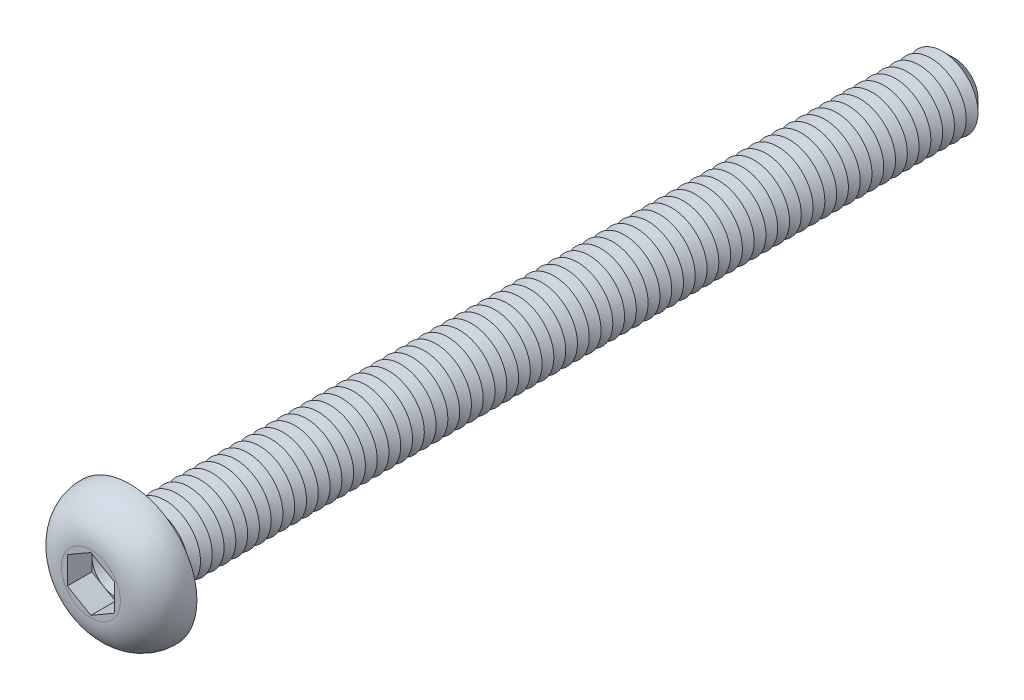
from build123d import *

# Parameters (mm, degrees)
CUT_EXTRUDE1_DEPTH  = 1.04
SKETCH4_R           = 1.5
BOSS_EXTRUDE1_DEPTH = 35
CHAMFER1_SIZE       = 0.5
LPATTERN1_COUNT     = 68
LPATTERN1_PITCH     = 0.5
FILLET2_R           = 0.2


with BuildPart() as part:
    # Sketch2 → Revolve1 (revolve)
    with BuildSketch(Plane(origin=(0, 0, 0), x_dir=(0, 0, -1), z_dir=(1, 0, 0)), mode=Mode.PRIVATE) as revolve1_sk:
        with BuildLine():
            Line((0, 0), (-1.65, 0))
            Line((-1.65, 0), (-1.65, 1.250781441))
            ThreePointArc((-1.65, 1.250781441), (-1.163552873, 2.39969397), (0, 2.85))
            Line((0, 2.85), (0, 0))
        make_face()
    revolve(revolve1_sk.sketch.rotate(Axis((0, 0, 47.934239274), (0, 0, -1)), 90), axis=Axis((0, 0, 47.934239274), (0, 0, -1)))

    # Sketch3 → Cut-Extrude1 (cut)
    with BuildSketch(Plane.XY.offset(1.65)):
        Polygon((0, 1.154700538), (-1, 0.577350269), (-1, -0.577350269), (0, -1.154700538), (1, -0.577350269), (1, 0.577350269), align=None)
    extrude(amount=-CUT_EXTRUDE1_DEPTH, mode=Mode.SUBTRACT)

    # Sketch4 → Boss-Extrude1 (add)
    with BuildSketch(Plane(origin=(0, 0, 0), x_dir=(-1, 0, 0), z_dir=(0, 0, -1))):
        with Locations(Location((0, 0, 0), (0, 0, 180))):
            Circle(SKETCH4_R)
    extrude(amount=BOSS_EXTRUDE1_DEPTH)

    # Chamfer1
    chamfer1_edges = [part.edges().sort_by_distance(p)[0] for p in [
        (-1.5, 0, -35),
    ]]
    chamfer(chamfer1_edges, length=CHAMFER1_SIZE)

    # Sketch5 → Cut-Revolve1 (revolve, cut)
    with BuildSketch(Plane(origin=(0, 0, 0), x_dir=(0, 0, -1), z_dir=(1, 0, 0)), mode=Mode.PRIVATE) as cut_revolve1_sk:
        Polygon((0.5, 1.5), (1, 1.5), (0.75, 1.066987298), align=None)
    cut_revolve1 = revolve(cut_revolve1_sk.sketch.rotate(Axis((0, 0, 47.934239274), (0, 0, -1)), 90), axis=Axis((0, 0, 47.934239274), (0, 0, -1)), mode=Mode.SUBTRACT)

    # LPattern1: Cut-Revolve1 ×68
    with Locations(*[(0, 0, -i * LPATTERN1_PITCH) for i in range(1, LPATTERN1_COUNT)]):
        add(cut_revolve1, mode=Mode.SUBTRACT)

    # Fillet2
    fillet2_edges = [part.edges().sort_by_distance(p)[0] for p in [
        (-1.5, 0, 0),
    ]]
    fillet(fillet2_edges, radius=FILLET2_R)

    # Cut-Extrude2 cone 1 section (on through the dimple's axis) → Cut-Extrude2 (revolve, cut)
    with BuildSketch(Plane(origin=(0, 0, 0.61), x_dir=(0, -1, 0), z_dir=(1, 0, 0))):
        Polygon((0, 0), (1, 0), (0, 0.577350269), align=None)
    revolve(axis=Axis((0, 0, 0.61), (0, 0, -1)), mode=Mode.SUBTRACT)


solid = part.part
